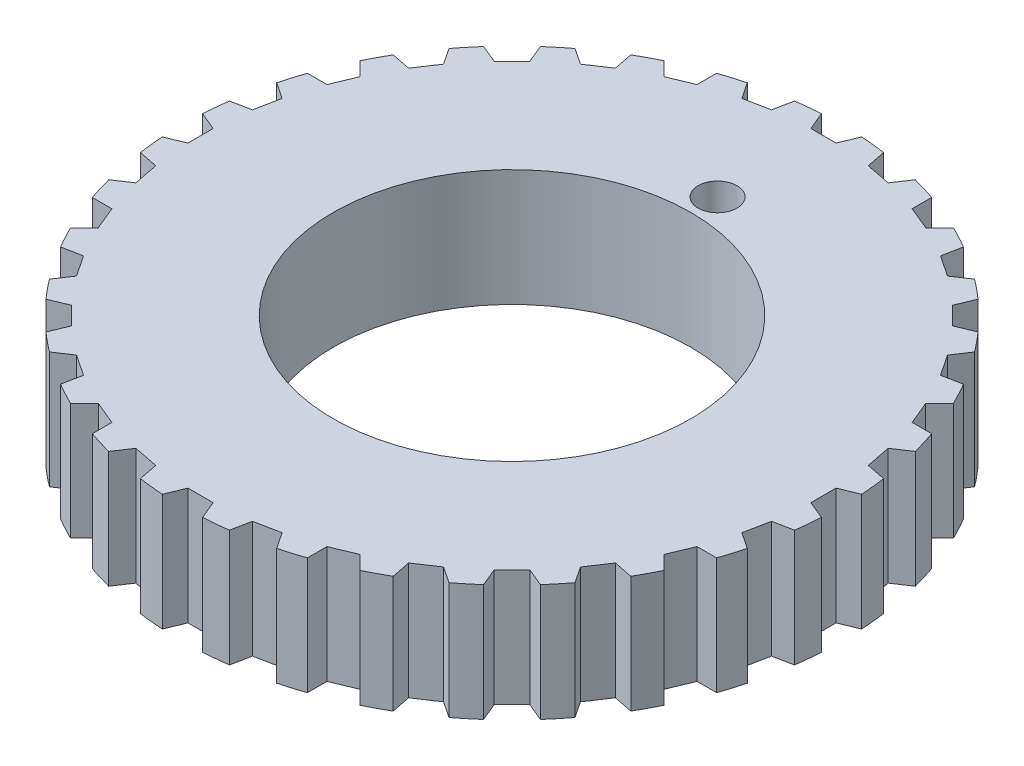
from build123d import *

# Parameters (mm, degrees)
SKETCH1_R          = 13.462
SKETCH1_R_2        = 7.2898
EXTRUDE1_DEPTH     = 4.7625
CUT_EXTRUDE1_DEPTH = 20.62478775
CIRPATTERN1_COUNT  = 32
SKETCH8_R          = 0.79375
CUT_EXTRUDE2_DEPTH = 20.590525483


with BuildPart() as part:
    # Sketch1 → Extrude1 (new body)
    with BuildSketch(Plane(origin=(0, 0, 0), x_dir=(1, 0, 0), z_dir=(0, 1, 0))):
        with Locations(Location((0, 0, 0), (0, 0, 90))):
            Circle(SKETCH1_R)
        with Locations(Location((0, 0, 0), (0, 0, 90))):
            Circle(SKETCH1_R_2, mode=Mode.SUBTRACT)
    extrude(amount=EXTRUDE1_DEPTH)

    # Sketch6 → Cut-Extrude1 (cut, through all)
    with BuildSketch(Plane(origin=(0, 0, 0), x_dir=(-1, 0, 0), z_dir=(0, 1, 0))):
        Polygon((-13.97, -1.040401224), (-13.97, 1.040401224), (-12.7, 0.51435), (-12.7, -0.51435), align=None)
    cut_extrude1 = extrude(amount=CUT_EXTRUDE1_DEPTH, mode=Mode.SUBTRACT)

    # CirPattern1: Cut-Extrude1 ×32 about axis
    cirpattern1_axis = Axis((0, 0, 0), (0, 1, 0))
    for i in range(1, CIRPATTERN1_COUNT):
        add(cut_extrude1.rotate(cirpattern1_axis, i * 360 / CIRPATTERN1_COUNT), mode=Mode.SUBTRACT)

    # Sketch8 → Cut-Extrude2 (cut, through all)
    with BuildSketch(Plane(origin=(0, 4.7625, 0), x_dir=(1, 0, 0), z_dir=(0, 1, 0))):
        with Locations(Location((0, 8.382, 0), (0, 0, 270))):
            Circle(SKETCH8_R)
    extrude(amount=-CUT_EXTRUDE2_DEPTH, mode=Mode.SUBTRACT)


solid = part.part
